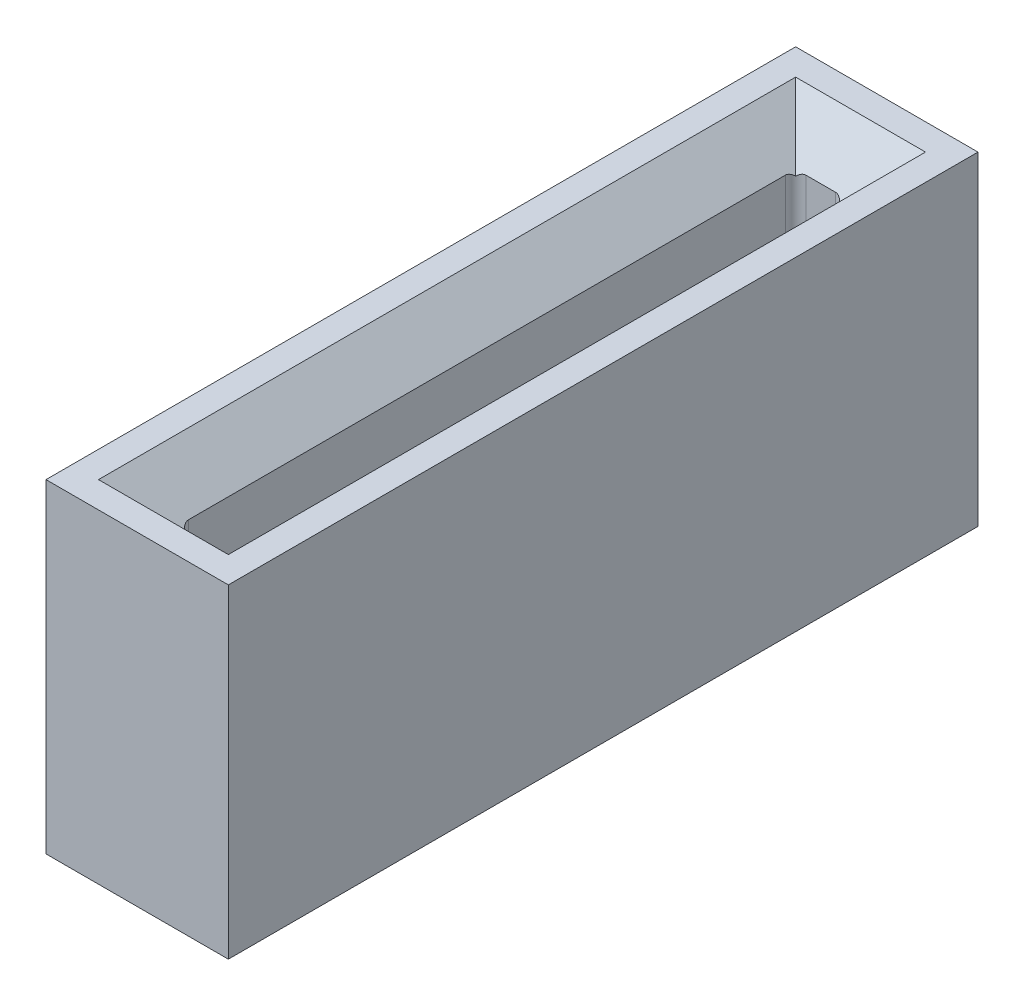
ISO-10303-21;
HEADER;
FILE_DESCRIPTION(('STEP AP214'),'2;1');
FILE_NAME('part.step','',(''),(''),'','','');
FILE_SCHEMA(('AUTOMOTIVE_DESIGN { 1 0 10303 214 1 1 1 1 }'));
ENDSEC;
DATA;
#1=APPLICATION_CONTEXT('core data for automotive mechanical design processes');
#2=APPLICATION_PROTOCOL_DEFINITION('international standard','automotive_design',2000,#1);
#3=PRODUCT_CONTEXT('',#1,'mechanical');
#4=PRODUCT('Part','Part','',(#3));
#5=PRODUCT_RELATED_PRODUCT_CATEGORY('part','',(#4));
#6=PRODUCT_DEFINITION_FORMATION('','',#4);
#7=PRODUCT_DEFINITION_CONTEXT('part definition',#1,'design');
#8=PRODUCT_DEFINITION('design','',#6,#7);
#9=PRODUCT_DEFINITION_SHAPE('','',#8);
#10=(LENGTH_UNIT() NAMED_UNIT(*) SI_UNIT(.MILLI.,.METRE.));
#11=(NAMED_UNIT(*) PLANE_ANGLE_UNIT() SI_UNIT($,.RADIAN.));
#12=(NAMED_UNIT(*) SI_UNIT($,.STERADIAN.) SOLID_ANGLE_UNIT());
#13=UNCERTAINTY_MEASURE_WITH_UNIT(LENGTH_MEASURE(1.E-05),#10,'distance_accuracy_value','');
#14=(GEOMETRIC_REPRESENTATION_CONTEXT(3) GLOBAL_UNCERTAINTY_ASSIGNED_CONTEXT((#13)) GLOBAL_UNIT_ASSIGNED_CONTEXT((#10,
#11,#12)) REPRESENTATION_CONTEXT('',''));
#15=CARTESIAN_POINT('',(0.,0.,0.));
#16=DIRECTION('',(0.,0.,1.));
#17=DIRECTION('',(1.,0.,0.));
#18=AXIS2_PLACEMENT_3D('',#15,#16,#17);
#19=CARTESIAN_POINT('',(0.,203.2,0.));
#20=DIRECTION('',(0.,1.,0.));
#21=DIRECTION('',(0.,0.,1.));
#22=AXIS2_PLACEMENT_3D('',#19,#20,#21);
#23=PLANE('',#22);
#24=DIRECTION('',(0.,0.,-1.));
#25=VECTOR('',#24,1.);
#26=CARTESIAN_POINT('',(-81.4,203.2,0.));
#27=LINE('',#26,#25);
#28=CARTESIAN_POINT('',(-81.4,203.2,437.));
#29=VERTEX_POINT('',#28);
#30=CARTESIAN_POINT('',(-81.4000000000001,203.2,-437.));
#31=VERTEX_POINT('',#30);
#32=EDGE_CURVE('E261',#29,#31,#27,.T.);
#33=ORIENTED_EDGE('',*,*,#32,.T.);
#34=DIRECTION('',(1.,0.,0.));
#35=VECTOR('',#34,1.);
#36=CARTESIAN_POINT('',(0.,203.2,-437.));
#37=LINE('',#36,#35);
#38=CARTESIAN_POINT('',(81.4,203.2,-437.));
#39=VERTEX_POINT('',#38);
#40=EDGE_CURVE('E271',#31,#39,#37,.T.);
#41=ORIENTED_EDGE('',*,*,#40,.T.);
#42=DIRECTION('',(0.,0.,1.));
#43=VECTOR('',#42,1.);
#44=CARTESIAN_POINT('',(81.4,203.2,0.));
#45=LINE('',#44,#43);
#46=CARTESIAN_POINT('',(81.4000000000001,203.2,437.));
#47=VERTEX_POINT('',#46);
#48=EDGE_CURVE('E266',#39,#47,#45,.T.);
#49=ORIENTED_EDGE('',*,*,#48,.T.);
#50=DIRECTION('',(-1.,0.,0.));
#51=VECTOR('',#50,1.);
#52=CARTESIAN_POINT('',(0.,203.2,437.));
#53=LINE('',#52,#51);
#54=EDGE_CURVE('E269',#47,#29,#53,.T.);
#55=ORIENTED_EDGE('',*,*,#54,.T.);
#56=EDGE_LOOP('',(#33,#41,#49,#55));
#57=FACE_BOUND('',#56,.T.);
#58=DIRECTION('',(1.,0.,0.));
#59=VECTOR('',#58,1.);
#60=CARTESIAN_POINT('',(-114.3,203.2,469.9));
#61=LINE('',#60,#59);
#62=CARTESIAN_POINT('',(-114.3,203.2,469.9));
#63=VERTEX_POINT('',#62);
#64=CARTESIAN_POINT('',(114.3,203.2,469.9));
#65=VERTEX_POINT('',#64);
#66=EDGE_CURVE('E200',#63,#65,#61,.T.);
#67=ORIENTED_EDGE('',*,*,#66,.T.);
#68=DIRECTION('',(0.,0.,-1.));
#69=VECTOR('',#68,1.);
#70=CARTESIAN_POINT('',(114.3,203.2,469.9));
#71=LINE('',#70,#69);
#72=CARTESIAN_POINT('',(114.3,203.2,-469.9));
#73=VERTEX_POINT('',#72);
#74=EDGE_CURVE('E187',#65,#73,#71,.T.);
#75=ORIENTED_EDGE('',*,*,#74,.T.);
#76=DIRECTION('',(-1.,0.,0.));
#77=VECTOR('',#76,1.);
#78=CARTESIAN_POINT('',(114.3,203.2,-469.9));
#79=LINE('',#78,#77);
#80=CARTESIAN_POINT('',(-114.3,203.2,-469.9));
#81=VERTEX_POINT('',#80);
#82=EDGE_CURVE('E199',#73,#81,#79,.T.);
#83=ORIENTED_EDGE('',*,*,#82,.T.);
#84=DIRECTION('',(0.,0.,1.));
#85=VECTOR('',#84,1.);
#86=CARTESIAN_POINT('',(-114.3,203.2,-469.9));
#87=LINE('',#86,#85);
#88=EDGE_CURVE('E204',#81,#63,#87,.T.);
#89=ORIENTED_EDGE('',*,*,#88,.T.);
#90=EDGE_LOOP('',(#67,#75,#83,#89));
#91=FACE_BOUND('',#90,.T.);
#92=ADVANCED_FACE('F50',(#57,#91),#23,.T.);
#93=CARTESIAN_POINT('',(0.,-203.2,0.));
#94=DIRECTION('',(0.,1.,0.));
#95=DIRECTION('',(0.,0.,1.));
#96=AXIS2_PLACEMENT_3D('',#93,#94,#95);
#97=PLANE('',#96);
#98=DIRECTION('',(-1.,0.,0.));
#99=VECTOR('',#98,1.);
#100=CARTESIAN_POINT('',(-31.4,-203.2,-437.));
#101=LINE('',#100,#99);
#102=CARTESIAN_POINT('',(81.3999999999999,-203.2,-437.));
#103=VERTEX_POINT('',#102);
#104=CARTESIAN_POINT('',(-81.4,-203.2,-437.));
#105=VERTEX_POINT('',#104);
#106=EDGE_CURVE('E219',#103,#105,#101,.T.);
#107=ORIENTED_EDGE('',*,*,#106,.T.);
#108=DIRECTION('',(0.,0.,1.));
#109=VECTOR('',#108,1.);
#110=CARTESIAN_POINT('',(-81.3999999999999,-203.2,387.));
#111=LINE('',#110,#109);
#112=CARTESIAN_POINT('',(-81.3999999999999,-203.2,437.));
#113=VERTEX_POINT('',#112);
#114=EDGE_CURVE('E226',#105,#113,#111,.T.);
#115=ORIENTED_EDGE('',*,*,#114,.T.);
#116=DIRECTION('',(1.,0.,0.));
#117=VECTOR('',#116,1.);
#118=CARTESIAN_POINT('',(31.4,-203.2,437.));
#119=LINE('',#118,#117);
#120=CARTESIAN_POINT('',(81.4,-203.2,437.));
#121=VERTEX_POINT('',#120);
#122=EDGE_CURVE('E221',#113,#121,#119,.T.);
#123=ORIENTED_EDGE('',*,*,#122,.T.);
#124=DIRECTION('',(0.,0.,-1.));
#125=VECTOR('',#124,1.);
#126=CARTESIAN_POINT('',(81.3999999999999,-203.2,-387.));
#127=LINE('',#126,#125);
#128=EDGE_CURVE('E214',#121,#103,#127,.T.);
#129=ORIENTED_EDGE('',*,*,#128,.T.);
#130=EDGE_LOOP('',(#107,#115,#123,#129));
#131=FACE_BOUND('',#130,.T.);
#132=DIRECTION('',(1.,0.,0.));
#133=VECTOR('',#132,1.);
#134=CARTESIAN_POINT('',(-114.3,-203.2,469.9));
#135=LINE('',#134,#133);
#136=CARTESIAN_POINT('',(-114.3,-203.2,469.9));
#137=VERTEX_POINT('',#136);
#138=CARTESIAN_POINT('',(114.3,-203.2,469.9));
#139=VERTEX_POINT('',#138);
#140=EDGE_CURVE('E212',#137,#139,#135,.T.);
#141=ORIENTED_EDGE('',*,*,#140,.F.);
#142=DIRECTION('',(0.,0.,1.));
#143=VECTOR('',#142,1.);
#144=CARTESIAN_POINT('',(-114.3,-203.2,-469.9));
#145=LINE('',#144,#143);
#146=CARTESIAN_POINT('',(-114.3,-203.2,-469.9));
#147=VERTEX_POINT('',#146);
#148=EDGE_CURVE('E210',#147,#137,#145,.T.);
#149=ORIENTED_EDGE('',*,*,#148,.F.);
#150=DIRECTION('',(-1.,0.,0.));
#151=VECTOR('',#150,1.);
#152=CARTESIAN_POINT('',(114.3,-203.2,-469.9));
#153=LINE('',#152,#151);
#154=CARTESIAN_POINT('',(114.3,-203.2,-469.9));
#155=VERTEX_POINT('',#154);
#156=EDGE_CURVE('E451',#155,#147,#153,.T.);
#157=ORIENTED_EDGE('',*,*,#156,.F.);
#158=DIRECTION('',(0.,0.,-1.));
#159=VECTOR('',#158,1.);
#160=CARTESIAN_POINT('',(114.3,-203.2,469.9));
#161=LINE('',#160,#159);
#162=EDGE_CURVE('E448',#139,#155,#161,.T.);
#163=ORIENTED_EDGE('',*,*,#162,.F.);
#164=EDGE_LOOP('',(#141,#149,#157,#163));
#165=FACE_BOUND('',#164,.T.);
#166=ADVANCED_FACE('F443',(#131,#165),#97,.F.);
#167=CARTESIAN_POINT('',(-114.3,203.2,469.9));
#168=DIRECTION('',(0.,0.,-1.));
#169=DIRECTION('',(-1.,0.,0.));
#170=AXIS2_PLACEMENT_3D('',#167,#168,#169);
#171=PLANE('',#170);
#172=ORIENTED_EDGE('',*,*,#140,.T.);
#173=DIRECTION('',(0.,-1.,0.));
#174=VECTOR('',#173,1.);
#175=CARTESIAN_POINT('',(114.3,203.2,469.9));
#176=LINE('',#175,#174);
#177=EDGE_CURVE('E188',#65,#139,#176,.T.);
#178=ORIENTED_EDGE('',*,*,#177,.F.);
#179=ORIENTED_EDGE('',*,*,#66,.F.);
#180=DIRECTION('',(0.,-1.,0.));
#181=VECTOR('',#180,1.);
#182=CARTESIAN_POINT('',(-114.3,203.2,469.9));
#183=LINE('',#182,#181);
#184=EDGE_CURVE('E462',#63,#137,#183,.T.);
#185=ORIENTED_EDGE('',*,*,#184,.T.);
#186=EDGE_LOOP('',(#172,#178,#179,#185));
#187=FACE_BOUND('',#186,.T.);
#188=ADVANCED_FACE('F209',(#187),#171,.F.);
#189=CARTESIAN_POINT('',(114.3,203.2,469.9));
#190=DIRECTION('',(-1.,0.,0.));
#191=DIRECTION('',(0.,0.,1.));
#192=AXIS2_PLACEMENT_3D('',#189,#190,#191);
#193=PLANE('',#192);
#194=ORIENTED_EDGE('',*,*,#162,.T.);
#195=DIRECTION('',(0.,-1.,0.));
#196=VECTOR('',#195,1.);
#197=CARTESIAN_POINT('',(114.3,203.2,-469.9));
#198=LINE('',#197,#196);
#199=EDGE_CURVE('E194',#73,#155,#198,.T.);
#200=ORIENTED_EDGE('',*,*,#199,.F.);
#201=ORIENTED_EDGE('',*,*,#74,.F.);
#202=ORIENTED_EDGE('',*,*,#177,.T.);
#203=EDGE_LOOP('',(#194,#200,#201,#202));
#204=FACE_BOUND('',#203,.T.);
#205=ADVANCED_FACE('F189',(#204),#193,.F.);
#206=CARTESIAN_POINT('',(114.3,203.2,-469.9));
#207=DIRECTION('',(0.,0.,1.));
#208=DIRECTION('',(1.,0.,0.));
#209=AXIS2_PLACEMENT_3D('',#206,#207,#208);
#210=PLANE('',#209);
#211=ORIENTED_EDGE('',*,*,#156,.T.);
#212=DIRECTION('',(0.,-1.,0.));
#213=VECTOR('',#212,1.);
#214=CARTESIAN_POINT('',(-114.3,203.2,-469.9));
#215=LINE('',#214,#213);
#216=EDGE_CURVE('E216',#81,#147,#215,.T.);
#217=ORIENTED_EDGE('',*,*,#216,.F.);
#218=ORIENTED_EDGE('',*,*,#82,.F.);
#219=ORIENTED_EDGE('',*,*,#199,.T.);
#220=EDGE_LOOP('',(#211,#217,#218,#219));
#221=FACE_BOUND('',#220,.T.);
#222=ADVANCED_FACE('F472',(#221),#210,.F.);
#223=CARTESIAN_POINT('',(-114.3,203.2,-469.9));
#224=DIRECTION('',(1.,0.,0.));
#225=DIRECTION('',(0.,0.,-1.));
#226=AXIS2_PLACEMENT_3D('',#223,#224,#225);
#227=PLANE('',#226);
#228=ORIENTED_EDGE('',*,*,#148,.T.);
#229=ORIENTED_EDGE('',*,*,#184,.F.);
#230=ORIENTED_EDGE('',*,*,#88,.F.);
#231=ORIENTED_EDGE('',*,*,#216,.T.);
#232=EDGE_LOOP('',(#228,#229,#230,#231));
#233=FACE_BOUND('',#232,.T.);
#234=ADVANCED_FACE('F469',(#233),#227,.F.);
#235=CARTESIAN_POINT('',(-31.3999999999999,203.2,387.));
#236=DIRECTION('',(0.,0.,-1.));
#237=DIRECTION('',(-1.,0.,0.));
#238=AXIS2_PLACEMENT_3D('',#235,#236,#237);
#239=PLANE('',#238);
#240=DIRECTION('',(-1.,0.,0.));
#241=VECTOR('',#240,1.);
#242=CARTESIAN_POINT('',(-31.3999999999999,-153.2,387.));
#243=LINE('',#242,#241);
#244=CARTESIAN_POINT('',(18.4,-153.2,387.));
#245=VERTEX_POINT('',#244);
#246=CARTESIAN_POINT('',(-18.4,-153.2,387.));
#247=VERTEX_POINT('',#246);
#248=EDGE_CURVE('E242',#245,#247,#243,.T.);
#249=ORIENTED_EDGE('',*,*,#248,.T.);
#250=DIRECTION('',(0.,-1.,0.));
#251=VECTOR('',#250,1.);
#252=CARTESIAN_POINT('',(-18.4,153.2,387.));
#253=LINE('',#252,#251);
#254=CARTESIAN_POINT('',(-18.4,153.2,387.));
#255=VERTEX_POINT('',#254);
#256=EDGE_CURVE('E315',#247,#255,#253,.F.);
#257=ORIENTED_EDGE('',*,*,#256,.T.);
#258=DIRECTION('',(1.,0.,0.));
#259=VECTOR('',#258,1.);
#260=CARTESIAN_POINT('',(-31.3999999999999,153.2,387.));
#261=LINE('',#260,#259);
#262=CARTESIAN_POINT('',(18.4,153.2,387.));
#263=VERTEX_POINT('',#262);
#264=EDGE_CURVE('E239',#255,#263,#261,.T.);
#265=ORIENTED_EDGE('',*,*,#264,.T.);
#266=DIRECTION('',(0.,-1.,0.));
#267=VECTOR('',#266,1.);
#268=CARTESIAN_POINT('',(18.4,-153.2,387.));
#269=LINE('',#268,#267);
#270=EDGE_CURVE('E308',#263,#245,#269,.T.);
#271=ORIENTED_EDGE('',*,*,#270,.T.);
#272=EDGE_LOOP('',(#249,#257,#265,#271));
#273=FACE_BOUND('',#272,.T.);
#274=ADVANCED_FACE('F438',(#273),#239,.T.);
#275=CARTESIAN_POINT('',(31.4,203.2,387.));
#276=DIRECTION('',(-1.,0.,0.));
#277=DIRECTION('',(0.,0.,1.));
#278=AXIS2_PLACEMENT_3D('',#275,#276,#277);
#279=PLANE('',#278);
#280=DIRECTION('',(0.,0.,1.));
#281=VECTOR('',#280,1.);
#282=CARTESIAN_POINT('',(31.4,-153.2,387.));
#283=LINE('',#282,#281);
#284=CARTESIAN_POINT('',(31.3999999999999,-153.2,-374.));
#285=VERTEX_POINT('',#284);
#286=CARTESIAN_POINT('',(31.4,-153.2,374.));
#287=VERTEX_POINT('',#286);
#288=EDGE_CURVE('E258',#285,#287,#283,.T.);
#289=ORIENTED_EDGE('',*,*,#288,.T.);
#290=DIRECTION('',(0.,-1.,0.));
#291=VECTOR('',#290,1.);
#292=CARTESIAN_POINT('',(31.4,153.2,374.));
#293=LINE('',#292,#291);
#294=CARTESIAN_POINT('',(31.4,153.2,374.));
#295=VERTEX_POINT('',#294);
#296=EDGE_CURVE('E316',#287,#295,#293,.F.);
#297=ORIENTED_EDGE('',*,*,#296,.T.);
#298=DIRECTION('',(0.,0.,-1.));
#299=VECTOR('',#298,1.);
#300=CARTESIAN_POINT('',(31.4,153.2,387.));
#301=LINE('',#300,#299);
#302=CARTESIAN_POINT('',(31.3999999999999,153.2,-374.));
#303=VERTEX_POINT('',#302);
#304=EDGE_CURVE('E257',#295,#303,#301,.T.);
#305=ORIENTED_EDGE('',*,*,#304,.T.);
#306=DIRECTION('',(0.,-1.,0.));
#307=VECTOR('',#306,1.);
#308=CARTESIAN_POINT('',(31.3999999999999,-153.2,-374.));
#309=LINE('',#308,#307);
#310=EDGE_CURVE('E314',#303,#285,#309,.T.);
#311=ORIENTED_EDGE('',*,*,#310,.T.);
#312=EDGE_LOOP('',(#289,#297,#305,#311));
#313=FACE_BOUND('',#312,.T.);
#314=ADVANCED_FACE('F426',(#313),#279,.T.);
#315=CARTESIAN_POINT('',(31.3999999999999,203.2,-387.));
#316=DIRECTION('',(0.,0.,1.));
#317=DIRECTION('',(1.,0.,0.));
#318=AXIS2_PLACEMENT_3D('',#315,#316,#317);
#319=PLANE('',#318);
#320=DIRECTION('',(1.,0.,0.));
#321=VECTOR('',#320,1.);
#322=CARTESIAN_POINT('',(31.3999999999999,-153.2,-387.));
#323=LINE('',#322,#321);
#324=CARTESIAN_POINT('',(-18.4,-153.2,-387.));
#325=VERTEX_POINT('',#324);
#326=CARTESIAN_POINT('',(18.4,-153.2,-387.));
#327=VERTEX_POINT('',#326);
#328=EDGE_CURVE('E255',#325,#327,#323,.T.);
#329=ORIENTED_EDGE('',*,*,#328,.T.);
#330=DIRECTION('',(0.,-1.,0.));
#331=VECTOR('',#330,1.);
#332=CARTESIAN_POINT('',(18.4,153.2,-387.));
#333=LINE('',#332,#331);
#334=CARTESIAN_POINT('',(18.4,153.2,-387.));
#335=VERTEX_POINT('',#334);
#336=EDGE_CURVE('E327',#327,#335,#333,.F.);
#337=ORIENTED_EDGE('',*,*,#336,.T.);
#338=DIRECTION('',(-1.,0.,0.));
#339=VECTOR('',#338,1.);
#340=CARTESIAN_POINT('',(31.3999999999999,153.2,-387.));
#341=LINE('',#340,#339);
#342=CARTESIAN_POINT('',(-18.4,153.2,-387.));
#343=VERTEX_POINT('',#342);
#344=EDGE_CURVE('E247',#335,#343,#341,.T.);
#345=ORIENTED_EDGE('',*,*,#344,.T.);
#346=DIRECTION('',(0.,-1.,0.));
#347=VECTOR('',#346,1.);
#348=CARTESIAN_POINT('',(-18.4,-153.2,-387.));
#349=LINE('',#348,#347);
#350=EDGE_CURVE('E325',#343,#325,#349,.T.);
#351=ORIENTED_EDGE('',*,*,#350,.T.);
#352=EDGE_LOOP('',(#329,#337,#345,#351));
#353=FACE_BOUND('',#352,.T.);
#354=ADVANCED_FACE('F388',(#353),#319,.T.);
#355=CARTESIAN_POINT('',(-31.4,203.2,-387.));
#356=DIRECTION('',(1.,0.,0.));
#357=DIRECTION('',(0.,0.,-1.));
#358=AXIS2_PLACEMENT_3D('',#355,#356,#357);
#359=PLANE('',#358);
#360=DIRECTION('',(0.,0.,1.));
#361=VECTOR('',#360,1.);
#362=CARTESIAN_POINT('',(-31.4,153.2,-387.));
#363=LINE('',#362,#361);
#364=CARTESIAN_POINT('',(-31.4,153.2,-374.));
#365=VERTEX_POINT('',#364);
#366=CARTESIAN_POINT('',(-31.3999999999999,153.2,374.));
#367=VERTEX_POINT('',#366);
#368=EDGE_CURVE('E235',#365,#367,#363,.T.);
#369=ORIENTED_EDGE('',*,*,#368,.T.);
#370=DIRECTION('',(0.,-1.,0.));
#371=VECTOR('',#370,1.);
#372=CARTESIAN_POINT('',(-31.3999999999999,-153.2,374.));
#373=LINE('',#372,#371);
#374=CARTESIAN_POINT('',(-31.3999999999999,-153.2,374.));
#375=VERTEX_POINT('',#374);
#376=EDGE_CURVE('E302',#367,#375,#373,.T.);
#377=ORIENTED_EDGE('',*,*,#376,.T.);
#378=DIRECTION('',(0.,0.,-1.));
#379=VECTOR('',#378,1.);
#380=CARTESIAN_POINT('',(-31.4,-153.2,-387.));
#381=LINE('',#380,#379);
#382=CARTESIAN_POINT('',(-31.4,-153.2,-374.));
#383=VERTEX_POINT('',#382);
#384=EDGE_CURVE('E236',#375,#383,#381,.T.);
#385=ORIENTED_EDGE('',*,*,#384,.T.);
#386=DIRECTION('',(0.,-1.,0.));
#387=VECTOR('',#386,1.);
#388=CARTESIAN_POINT('',(-31.4,153.2,-374.));
#389=LINE('',#388,#387);
#390=EDGE_CURVE('E280',#383,#365,#389,.F.);
#391=ORIENTED_EDGE('',*,*,#390,.T.);
#392=EDGE_LOOP('',(#369,#377,#385,#391));
#393=FACE_BOUND('',#392,.T.);
#394=ADVANCED_FACE('F418',(#393),#359,.T.);
#395=CARTESIAN_POINT('',(81.3999999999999,-203.2,0.));
#396=DIRECTION('',(-0.707106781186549,-0.707106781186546,0.));
#397=DIRECTION('',(0.,0.,1.));
#398=AXIS2_PLACEMENT_3D('',#395,#396,#397);
#399=PLANE('',#398);
#400=DIRECTION('',(-0.577350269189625,0.577350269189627,-0.577350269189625));
#401=VECTOR('',#400,1.);
#402=CARTESIAN_POINT('',(54.2666666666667,-176.066666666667,409.866666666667));
#403=LINE('',#402,#401);
#404=CARTESIAN_POINT('',(27.5923881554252,-149.392388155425,383.192388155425));
#405=VERTEX_POINT('',#404);
#406=EDGE_CURVE('E281',#405,#121,#403,.F.);
#407=ORIENTED_EDGE('',*,*,#406,.F.);
#408=CARTESIAN_POINT('',(18.4,-140.2,374.));
#409=DIRECTION('',(-0.707106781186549,-0.707106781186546,0.));
#410=DIRECTION('',(-0.707106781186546,0.707106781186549,0.));
#411=AXIS2_PLACEMENT_3D('',#408,#409,#410);
#412=ELLIPSE('',#411,18.3847763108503,13.);
#413=EDGE_CURVE('E349',#405,#287,#412,.F.);
#414=ORIENTED_EDGE('',*,*,#413,.T.);
#415=ORIENTED_EDGE('',*,*,#288,.F.);
#416=CARTESIAN_POINT('',(18.4,-140.2,-374.));
#417=DIRECTION('',(-0.707106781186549,-0.707106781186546,0.));
#418=DIRECTION('',(-0.707106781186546,0.707106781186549,0.));
#419=AXIS2_PLACEMENT_3D('',#416,#417,#418);
#420=ELLIPSE('',#419,18.3847763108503,13.);
#421=CARTESIAN_POINT('',(27.592388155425,-149.392388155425,-383.192388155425));
#422=VERTEX_POINT('',#421);
#423=EDGE_CURVE('E357',#285,#422,#420,.F.);
#424=ORIENTED_EDGE('',*,*,#423,.T.);
#425=DIRECTION('',(0.577350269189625,-0.577350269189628,-0.577350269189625));
#426=VECTOR('',#425,1.);
#427=CARTESIAN_POINT('',(54.2666666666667,-176.066666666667,-409.866666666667));
#428=LINE('',#427,#426);
#429=EDGE_CURVE('E287',#103,#422,#428,.F.);
#430=ORIENTED_EDGE('',*,*,#429,.F.);
#431=ORIENTED_EDGE('',*,*,#128,.F.);
#432=EDGE_LOOP('',(#407,#414,#415,#424,#430,#431));
#433=FACE_BOUND('',#432,.T.);
#434=ADVANCED_FACE('F428',(#433),#399,.T.);
#435=CARTESIAN_POINT('',(0.,-203.2,-437.));
#436=DIRECTION('',(0.,-0.707106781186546,0.707106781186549));
#437=DIRECTION('',(1.,0.,0.));
#438=AXIS2_PLACEMENT_3D('',#435,#436,#437);
#439=PLANE('',#438);
#440=ORIENTED_EDGE('',*,*,#429,.T.);
#441=CARTESIAN_POINT('',(18.4,-140.2,-374.));
#442=DIRECTION('',(0.,-0.707106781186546,0.707106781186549));
#443=DIRECTION('',(0.,0.707106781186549,0.707106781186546));
#444=AXIS2_PLACEMENT_3D('',#441,#442,#443);
#445=ELLIPSE('',#444,18.3847763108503,13.);
#446=EDGE_CURVE('E363',#422,#327,#445,.F.);
#447=ORIENTED_EDGE('',*,*,#446,.T.);
#448=ORIENTED_EDGE('',*,*,#328,.F.);
#449=CARTESIAN_POINT('',(-18.4,-140.2,-374.));
#450=DIRECTION('',(0.,-0.707106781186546,0.707106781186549));
#451=DIRECTION('',(0.,0.707106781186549,0.707106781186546));
#452=AXIS2_PLACEMENT_3D('',#449,#450,#451);
#453=ELLIPSE('',#452,18.3847763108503,13.);
#454=CARTESIAN_POINT('',(-27.5923881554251,-149.392388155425,-383.192388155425));
#455=VERTEX_POINT('',#454);
#456=EDGE_CURVE('E371',#325,#455,#453,.F.);
#457=ORIENTED_EDGE('',*,*,#456,.T.);
#458=DIRECTION('',(-0.577350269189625,-0.577350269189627,-0.577350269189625));
#459=VECTOR('',#458,1.);
#460=CARTESIAN_POINT('',(64.2666666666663,-57.5333333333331,-291.333333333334));
#461=LINE('',#460,#459);
#462=EDGE_CURVE('E68',#105,#455,#461,.F.);
#463=ORIENTED_EDGE('',*,*,#462,.F.);
#464=ORIENTED_EDGE('',*,*,#106,.F.);
#465=EDGE_LOOP('',(#440,#447,#448,#457,#463,#464));
#466=FACE_BOUND('',#465,.T.);
#467=ADVANCED_FACE('F416',(#466),#439,.T.);
#468=CARTESIAN_POINT('',(0.,-203.2,437.));
#469=DIRECTION('',(0.,-0.707106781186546,-0.707106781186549));
#470=DIRECTION('',(-1.,0.,0.));
#471=AXIS2_PLACEMENT_3D('',#468,#469,#470);
#472=PLANE('',#471);
#473=ORIENTED_EDGE('',*,*,#406,.T.);
#474=ORIENTED_EDGE('',*,*,#122,.F.);
#475=DIRECTION('',(0.577350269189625,0.577350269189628,-0.577350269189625));
#476=VECTOR('',#475,1.);
#477=CARTESIAN_POINT('',(64.2666666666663,-57.5333333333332,291.333333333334));
#478=LINE('',#477,#476);
#479=CARTESIAN_POINT('',(-27.5923881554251,-149.392388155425,383.192388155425));
#480=VERTEX_POINT('',#479);
#481=EDGE_CURVE('E279',#480,#113,#478,.F.);
#482=ORIENTED_EDGE('',*,*,#481,.F.);
#483=CARTESIAN_POINT('',(-18.4,-140.2,374.));
#484=DIRECTION('',(0.,-0.707106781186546,-0.707106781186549));
#485=DIRECTION('',(0.,0.707106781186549,-0.707106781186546));
#486=AXIS2_PLACEMENT_3D('',#483,#484,#485);
#487=ELLIPSE('',#486,18.3847763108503,13.);
#488=EDGE_CURVE('E332',#480,#247,#487,.F.);
#489=ORIENTED_EDGE('',*,*,#488,.T.);
#490=ORIENTED_EDGE('',*,*,#248,.F.);
#491=CARTESIAN_POINT('',(18.4,-140.2,374.));
#492=DIRECTION('',(0.,-0.707106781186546,-0.707106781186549));
#493=DIRECTION('',(0.,0.707106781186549,-0.707106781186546));
#494=AXIS2_PLACEMENT_3D('',#491,#492,#493);
#495=ELLIPSE('',#494,18.3847763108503,13.);
#496=EDGE_CURVE('E344',#245,#405,#495,.F.);
#497=ORIENTED_EDGE('',*,*,#496,.T.);
#498=EDGE_LOOP('',(#473,#474,#482,#489,#490,#497));
#499=FACE_BOUND('',#498,.T.);
#500=ADVANCED_FACE('F441',(#499),#472,.T.);
#501=CARTESIAN_POINT('',(-81.3999999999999,-203.2,0.));
#502=DIRECTION('',(0.707106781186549,-0.707106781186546,0.));
#503=DIRECTION('',(0.,0.,-1.));
#504=AXIS2_PLACEMENT_3D('',#501,#502,#503);
#505=PLANE('',#504);
#506=ORIENTED_EDGE('',*,*,#462,.T.);
#507=CARTESIAN_POINT('',(-18.4,-140.2,-374.));
#508=DIRECTION('',(0.707106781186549,-0.707106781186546,0.));
#509=DIRECTION('',(0.707106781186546,0.707106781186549,0.));
#510=AXIS2_PLACEMENT_3D('',#507,#508,#509);
#511=ELLIPSE('',#510,18.3847763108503,13.);
#512=EDGE_CURVE('E372',#455,#383,#511,.F.);
#513=ORIENTED_EDGE('',*,*,#512,.T.);
#514=ORIENTED_EDGE('',*,*,#384,.F.);
#515=CARTESIAN_POINT('',(-18.4,-140.2,374.));
#516=DIRECTION('',(0.707106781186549,-0.707106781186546,0.));
#517=DIRECTION('',(0.707106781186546,0.707106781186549,0.));
#518=AXIS2_PLACEMENT_3D('',#515,#516,#517);
#519=ELLIPSE('',#518,18.3847763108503,13.);
#520=EDGE_CURVE('E326',#375,#480,#519,.F.);
#521=ORIENTED_EDGE('',*,*,#520,.T.);
#522=ORIENTED_EDGE('',*,*,#481,.T.);
#523=ORIENTED_EDGE('',*,*,#114,.F.);
#524=EDGE_LOOP('',(#506,#513,#514,#521,#522,#523));
#525=FACE_BOUND('',#524,.T.);
#526=ADVANCED_FACE('F419',(#525),#505,.T.);
#527=CARTESIAN_POINT('',(-31.3999999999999,153.2,387.));
#528=DIRECTION('',(0.,-0.707106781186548,0.707106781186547));
#529=DIRECTION('',(1.,0.,0.));
#530=AXIS2_PLACEMENT_3D('',#527,#528,#529);
#531=PLANE('',#530);
#532=DIRECTION('',(0.577350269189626,-0.577350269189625,-0.577350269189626));
#533=VECTOR('',#532,1.);
#534=CARTESIAN_POINT('',(-31.3999999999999,153.2,387.));
#535=LINE('',#534,#533);
#536=CARTESIAN_POINT('',(-27.5923881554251,149.392388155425,383.192388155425));
#537=VERTEX_POINT('',#536);
#538=EDGE_CURVE('E298',#29,#537,#535,.T.);
#539=ORIENTED_EDGE('',*,*,#538,.F.);
#540=ORIENTED_EDGE('',*,*,#54,.F.);
#541=DIRECTION('',(-0.577350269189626,-0.577350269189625,-0.577350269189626));
#542=VECTOR('',#541,1.);
#543=CARTESIAN_POINT('',(31.4,153.2,387.));
#544=LINE('',#543,#542);
#545=CARTESIAN_POINT('',(27.5923881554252,149.392388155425,383.192388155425));
#546=VERTEX_POINT('',#545);
#547=EDGE_CURVE('E282',#546,#47,#544,.F.);
#548=ORIENTED_EDGE('',*,*,#547,.F.);
#549=CARTESIAN_POINT('',(18.4,140.2,374.));
#550=DIRECTION('',(0.,-0.707106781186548,0.707106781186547));
#551=DIRECTION('',(0.,0.707106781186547,0.707106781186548));
#552=AXIS2_PLACEMENT_3D('',#549,#550,#551);
#553=ELLIPSE('',#552,18.3847763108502,13.);
#554=EDGE_CURVE('E355',#546,#263,#553,.T.);
#555=ORIENTED_EDGE('',*,*,#554,.T.);
#556=ORIENTED_EDGE('',*,*,#264,.F.);
#557=CARTESIAN_POINT('',(-18.4,140.2,374.));
#558=DIRECTION('',(0.,-0.707106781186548,0.707106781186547));
#559=DIRECTION('',(0.,0.707106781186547,0.707106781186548));
#560=AXIS2_PLACEMENT_3D('',#557,#558,#559);
#561=ELLIPSE('',#560,18.3847763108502,13.);
#562=EDGE_CURVE('E337',#255,#537,#561,.T.);
#563=ORIENTED_EDGE('',*,*,#562,.T.);
#564=EDGE_LOOP('',(#539,#540,#548,#555,#556,#563));
#565=FACE_BOUND('',#564,.T.);
#566=ADVANCED_FACE('F409',(#565),#531,.F.);
#567=CARTESIAN_POINT('',(31.4,153.2,387.));
#568=DIRECTION('',(0.707106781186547,-0.707106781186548,0.));
#569=DIRECTION('',(0.,0.,-1.));
#570=AXIS2_PLACEMENT_3D('',#567,#568,#569);
#571=PLANE('',#570);
#572=ORIENTED_EDGE('',*,*,#547,.T.);
#573=ORIENTED_EDGE('',*,*,#48,.F.);
#574=DIRECTION('',(-0.577350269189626,-0.577350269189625,0.577350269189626));
#575=VECTOR('',#574,1.);
#576=CARTESIAN_POINT('',(31.3999999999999,153.2,-387.));
#577=LINE('',#576,#575);
#578=CARTESIAN_POINT('',(27.5923881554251,149.392388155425,-383.192388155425));
#579=VERTEX_POINT('',#578);
#580=EDGE_CURVE('E291',#579,#39,#577,.F.);
#581=ORIENTED_EDGE('',*,*,#580,.F.);
#582=CARTESIAN_POINT('',(18.4,140.2,-374.));
#583=DIRECTION('',(0.707106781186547,-0.707106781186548,0.));
#584=DIRECTION('',(0.707106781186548,0.707106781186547,0.));
#585=AXIS2_PLACEMENT_3D('',#582,#583,#584);
#586=ELLIPSE('',#585,18.3847763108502,13.);
#587=EDGE_CURVE('E368',#579,#303,#586,.T.);
#588=ORIENTED_EDGE('',*,*,#587,.T.);
#589=ORIENTED_EDGE('',*,*,#304,.F.);
#590=CARTESIAN_POINT('',(18.4,140.2,374.));
#591=DIRECTION('',(0.707106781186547,-0.707106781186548,0.));
#592=DIRECTION('',(0.707106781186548,0.707106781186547,0.));
#593=AXIS2_PLACEMENT_3D('',#590,#591,#592);
#594=ELLIPSE('',#593,18.3847763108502,13.);
#595=EDGE_CURVE('E348',#295,#546,#594,.T.);
#596=ORIENTED_EDGE('',*,*,#595,.T.);
#597=EDGE_LOOP('',(#572,#573,#581,#588,#589,#596));
#598=FACE_BOUND('',#597,.T.);
#599=ADVANCED_FACE('F396',(#598),#571,.F.);
#600=CARTESIAN_POINT('',(-31.4,153.2,-387.));
#601=DIRECTION('',(-0.707106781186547,-0.707106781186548,0.));
#602=DIRECTION('',(0.,0.,1.));
#603=AXIS2_PLACEMENT_3D('',#600,#601,#602);
#604=PLANE('',#603);
#605=ORIENTED_EDGE('',*,*,#538,.T.);
#606=CARTESIAN_POINT('',(-18.4,140.2,374.));
#607=DIRECTION('',(-0.707106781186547,-0.707106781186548,0.));
#608=DIRECTION('',(-0.707106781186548,0.707106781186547,0.));
#609=AXIS2_PLACEMENT_3D('',#606,#607,#608);
#610=ELLIPSE('',#609,18.3847763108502,13.);
#611=EDGE_CURVE('E338',#537,#367,#610,.T.);
#612=ORIENTED_EDGE('',*,*,#611,.T.);
#613=ORIENTED_EDGE('',*,*,#368,.F.);
#614=CARTESIAN_POINT('',(-18.4,140.2,-374.));
#615=DIRECTION('',(-0.707106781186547,-0.707106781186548,0.));
#616=DIRECTION('',(-0.707106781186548,0.707106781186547,0.));
#617=AXIS2_PLACEMENT_3D('',#614,#615,#616);
#618=ELLIPSE('',#617,18.3847763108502,13.);
#619=CARTESIAN_POINT('',(-27.5923881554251,149.392388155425,-383.192388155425));
#620=VERTEX_POINT('',#619);
#621=EDGE_CURVE('E57',#365,#620,#618,.T.);
#622=ORIENTED_EDGE('',*,*,#621,.T.);
#623=DIRECTION('',(-0.577350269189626,0.577350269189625,-0.577350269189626));
#624=VECTOR('',#623,1.);
#625=CARTESIAN_POINT('',(-10.4666666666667,132.266666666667,-366.066666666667));
#626=LINE('',#625,#624);
#627=EDGE_CURVE('E65',#31,#620,#626,.F.);
#628=ORIENTED_EDGE('',*,*,#627,.F.);
#629=ORIENTED_EDGE('',*,*,#32,.F.);
#630=EDGE_LOOP('',(#605,#612,#613,#622,#628,#629));
#631=FACE_BOUND('',#630,.T.);
#632=ADVANCED_FACE('F382',(#631),#604,.F.);
#633=CARTESIAN_POINT('',(31.3999999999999,153.2,-387.));
#634=DIRECTION('',(0.,-0.707106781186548,-0.707106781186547));
#635=DIRECTION('',(-1.,0.,0.));
#636=AXIS2_PLACEMENT_3D('',#633,#634,#635);
#637=PLANE('',#636);
#638=ORIENTED_EDGE('',*,*,#580,.T.);
#639=ORIENTED_EDGE('',*,*,#40,.F.);
#640=ORIENTED_EDGE('',*,*,#627,.T.);
#641=CARTESIAN_POINT('',(-18.4,140.2,-374.));
#642=DIRECTION('',(0.,-0.707106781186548,-0.707106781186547));
#643=DIRECTION('',(0.,0.707106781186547,-0.707106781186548));
#644=AXIS2_PLACEMENT_3D('',#641,#642,#643);
#645=ELLIPSE('',#644,18.3847763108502,13.);
#646=EDGE_CURVE('E11',#620,#343,#645,.T.);
#647=ORIENTED_EDGE('',*,*,#646,.T.);
#648=ORIENTED_EDGE('',*,*,#344,.F.);
#649=CARTESIAN_POINT('',(18.4,140.2,-374.));
#650=DIRECTION('',(0.,-0.707106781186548,-0.707106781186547));
#651=DIRECTION('',(0.,0.707106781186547,-0.707106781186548));
#652=AXIS2_PLACEMENT_3D('',#649,#650,#651);
#653=ELLIPSE('',#652,18.3847763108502,13.);
#654=EDGE_CURVE('E364',#335,#579,#653,.T.);
#655=ORIENTED_EDGE('',*,*,#654,.T.);
#656=EDGE_LOOP('',(#638,#639,#640,#647,#648,#655));
#657=FACE_BOUND('',#656,.T.);
#658=ADVANCED_FACE('F390',(#657),#637,.F.);
#659=CARTESIAN_POINT('',(-18.4,203.2,374.));
#660=DIRECTION('',(0.,1.,0.));
#661=DIRECTION('',(0.,0.,1.));
#662=AXIS2_PLACEMENT_3D('',#659,#660,#661);
#663=CYLINDRICAL_SURFACE('',#662,13.);
#664=ORIENTED_EDGE('',*,*,#562,.F.);
#665=ORIENTED_EDGE('',*,*,#256,.F.);
#666=ORIENTED_EDGE('',*,*,#488,.F.);
#667=ORIENTED_EDGE('',*,*,#520,.F.);
#668=ORIENTED_EDGE('',*,*,#376,.F.);
#669=ORIENTED_EDGE('',*,*,#611,.F.);
#670=EDGE_LOOP('',(#664,#665,#666,#667,#668,#669));
#671=FACE_BOUND('',#670,.T.);
#672=ADVANCED_FACE('F414',(#671),#663,.F.);
#673=CARTESIAN_POINT('',(18.4,203.2,374.));
#674=DIRECTION('',(0.,1.,0.));
#675=DIRECTION('',(0.,0.,1.));
#676=AXIS2_PLACEMENT_3D('',#673,#674,#675);
#677=CYLINDRICAL_SURFACE('',#676,13.);
#678=ORIENTED_EDGE('',*,*,#595,.F.);
#679=ORIENTED_EDGE('',*,*,#296,.F.);
#680=ORIENTED_EDGE('',*,*,#413,.F.);
#681=ORIENTED_EDGE('',*,*,#496,.F.);
#682=ORIENTED_EDGE('',*,*,#270,.F.);
#683=ORIENTED_EDGE('',*,*,#554,.F.);
#684=EDGE_LOOP('',(#678,#679,#680,#681,#682,#683));
#685=FACE_BOUND('',#684,.T.);
#686=ADVANCED_FACE('F432',(#685),#677,.F.);
#687=CARTESIAN_POINT('',(18.4,203.2,-374.));
#688=DIRECTION('',(0.,1.,0.));
#689=DIRECTION('',(0.,0.,1.));
#690=AXIS2_PLACEMENT_3D('',#687,#688,#689);
#691=CYLINDRICAL_SURFACE('',#690,13.);
#692=ORIENTED_EDGE('',*,*,#654,.F.);
#693=ORIENTED_EDGE('',*,*,#336,.F.);
#694=ORIENTED_EDGE('',*,*,#446,.F.);
#695=ORIENTED_EDGE('',*,*,#423,.F.);
#696=ORIENTED_EDGE('',*,*,#310,.F.);
#697=ORIENTED_EDGE('',*,*,#587,.F.);
#698=EDGE_LOOP('',(#692,#693,#694,#695,#696,#697));
#699=FACE_BOUND('',#698,.T.);
#700=ADVANCED_FACE('F393',(#699),#691,.F.);
#701=CARTESIAN_POINT('',(-18.4,203.2,-374.));
#702=DIRECTION('',(0.,1.,0.));
#703=DIRECTION('',(0.,0.,1.));
#704=AXIS2_PLACEMENT_3D('',#701,#702,#703);
#705=CYLINDRICAL_SURFACE('',#704,13.);
#706=ORIENTED_EDGE('',*,*,#621,.F.);
#707=ORIENTED_EDGE('',*,*,#390,.F.);
#708=ORIENTED_EDGE('',*,*,#512,.F.);
#709=ORIENTED_EDGE('',*,*,#456,.F.);
#710=ORIENTED_EDGE('',*,*,#350,.F.);
#711=ORIENTED_EDGE('',*,*,#646,.F.);
#712=EDGE_LOOP('',(#706,#707,#708,#709,#710,#711));
#713=FACE_BOUND('',#712,.T.);
#714=ADVANCED_FACE('F47',(#713),#705,.F.);
#715=CLOSED_SHELL('',(#92,#166,#188,#205,#222,#234,#274,#314,#354,#394,#434,#467,#500,#526,#566,
#599,#632,#658,#672,#686,#700,#714));
#716=MANIFOLD_SOLID_BREP('B2',#715);
#717=ADVANCED_BREP_SHAPE_REPRESENTATION('',(#18,#716),#14);
#718=SHAPE_DEFINITION_REPRESENTATION(#9,#717);
ENDSEC;
END-ISO-10303-21;
